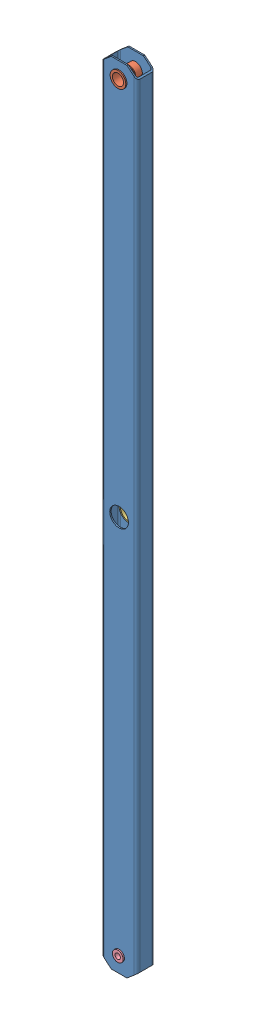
SolidWorks assembly ASM_Braccio_guida_inf.SLDASM, configuration 2 (file format 14000). Lengths in mm.
Overall size (80 1770 46).
6 component instances, 4 part files, 16 mates.
Components (placement in the parent):
- Braccio_guida_inf-1: Braccio_guida_inf.SLDPRT [Default<A macchina>] at (-206.7881 42.3542 1770) size (80 1770 40)
- Boccola_25_30_20_35_2.5-3: Boccola_25_30_20_35_2.5.SLDPRT [Default] at (-206.7881 892.3542 1767.5) x (0 0 1) z (-0.015747 -0.999876 0) size (20 35 35)
- Boccola_25_30_20_35_2.5-4: Boccola_25_30_20_35_2.5.SLDPRT [Default] at (-206.7881 892.3542 1772.5) x (0 0 -1) z (-0.015747 0.999876 0) size (20 35 35)
- Boccola_36_42_22_48_3-5: Boccola_36_42_22_48_3.SLDPRT [Default] at (-206.7881 42.3542 1769) x (0 0 1) z (0.923728 0.383049 0) size (22 48 48)
- Boccola_12_18_20_324_3-1: Boccola_12_18_20_324_3.SLDPRT [Default] at (-206.7881 -807.6458 1773) x (0 0 -1) z (1 0 0) size (20 24 24)
- Boccola_12_18_20_324_3-2: Boccola_12_18_20_324_3.SLDPRT [Default] at (-206.7881 -807.6458 1767) x (0 0 1) z (-0.923728 -0.383049 0) size (20 24 24)
Mates (geometry in assembly coordinates):
- Concentrico1: concentric anti-aligned: cylinder of Braccio_guida_inf-1 through (-206.7881 -807.6458 1690.603) axis (0 0 1) radius 9; cylinder of Boccola_supporto-1 through (-206.7881 -807.6458 1772.5) axis (0 0 -1) radius 15
- Coincidente1: coincident anti-aligned: plane of Braccio_guida_inf-1 through (-240.3881 -842.6458 1790) normal (0 0 1); plane of Boccola_supporto-1 through (-206.7881 -790.1458 1790) normal (0 0 -1)
- Concentrico2: concentric aligned: cylinder of Braccio_guida_inf-1 through (-206.7881 -807.6458 1690.603) axis (0 0 1) radius 9; cylinder of Boccola_supporto-2 through (-206.7881 -807.6458 1767.5) axis (0 0 1) radius 15
- Coincidente2: coincident anti-aligned: plane of Braccio_guida_inf-1 through (-173.1881 -842.6458 1750) normal (0 0 -1); plane of Boccola_supporto-2 through (-192.0783 -798.1656 1750) normal (0 0 1)
- Concentrico3: concentric aligned: cylinder of Braccio_guida_inf-1 through (-206.7881 892.3542 1690.603) axis (0 0 1) radius 15; cylinder of Boccola_supporto-3 through (-206.7881 892.3542 1767.5) axis (0 0 1) radius 15
- Coincidente3: coincident anti-aligned: plane of Braccio_guida_inf-1 through (-173.1881 -842.6458 1750) normal (0 0 -1); plane of Boccola_supporto-3 through (-224.2859 892.6298 1750) normal (0 0 1)
- Concentrico4: concentric anti-aligned: cylinder of Braccio_guida_inf-1 through (-206.7881 892.3542 1690.603) axis (0 0 1) radius 15; cylinder of Boccola_supporto-4 through (-206.7881 892.3542 1772.5) axis (0 0 -1) radius 15
- Coincidente4: coincident anti-aligned: plane of Braccio_guida_inf-1 through (-240.3881 -842.6458 1790) normal (0 0 1); plane of Boccola_supporto-4 through (-224.2859 892.0786 1790) normal (0 0 -1)
- Concentrico5: concentric anti-aligned: cylinder of Braccio_guida_inf-1 through (-206.7881 42.3542 1690.603) axis (0 0 1) radius 21; cylinder of Boccola_36_42_22_48_3-5 through (-206.7881 42.3542 1772) axis (0 0 -1) radius 21
- Coincidente5: coincident anti-aligned: plane of Braccio_guida_inf-1 through (-240.3881 -842.6458 1790) normal (0 0 1); plane of Boccola_36_42_22_48_3-5 through (-197.5949 64.5237 1790) normal (0 0 -1)
- Concentrico6: concentric aligned: cylinder of Braccio_guida_inf-1 through (-206.7881 42.3542 1690.603) axis (0 0 1) radius 21; cylinder of Boccola_36_42_22_48_3-5 through (-206.7881 42.3542 1769) axis (0 0 1) radius 21
- Coincidente6: coincident anti-aligned: plane of Braccio_guida_inf-1 through (-173.1881 -842.6458 1750) normal (0 0 -1); plane of Boccola_36_42_22_48_3-5 through (-197.5949 20.1847 1750) normal (0 0 1)
- Concentrico7: concentric anti-aligned: cylinder of Braccio_guida_inf-1 through (-206.7881 -807.6458 1690.603) axis (0 0 1) radius 9; cylinder of Boccola_12_18_20_324_3-1 through (-206.7881 -807.6458 1773) axis (0 0 -1) radius 9
- Coincidente7: coincident anti-aligned: plane of Braccio_guida_inf-1 through (-240.3881 -842.6458 1790) normal (0 0 1); plane of Boccola_12_18_20_324_3-1 through (-206.7881 -795.6458 1790) normal (0 0 -1)
- Concentrico8: concentric aligned: cylinder of Braccio_guida_inf-1 through (-206.7881 -807.6458 1690.603) axis (0 0 1) radius 9; cylinder of Boccola_12_18_20_324_3-2 through (-206.7881 -807.6458 1767) axis (0 0 1) radius 9
- Coincidente8: coincident anti-aligned: plane of Braccio_guida_inf-1 through (-173.1881 -842.6458 1750) normal (0 0 -1); plane of Boccola_12_18_20_324_3-2 through (-211.3847 -796.5611 1750) normal (0 0 1)
